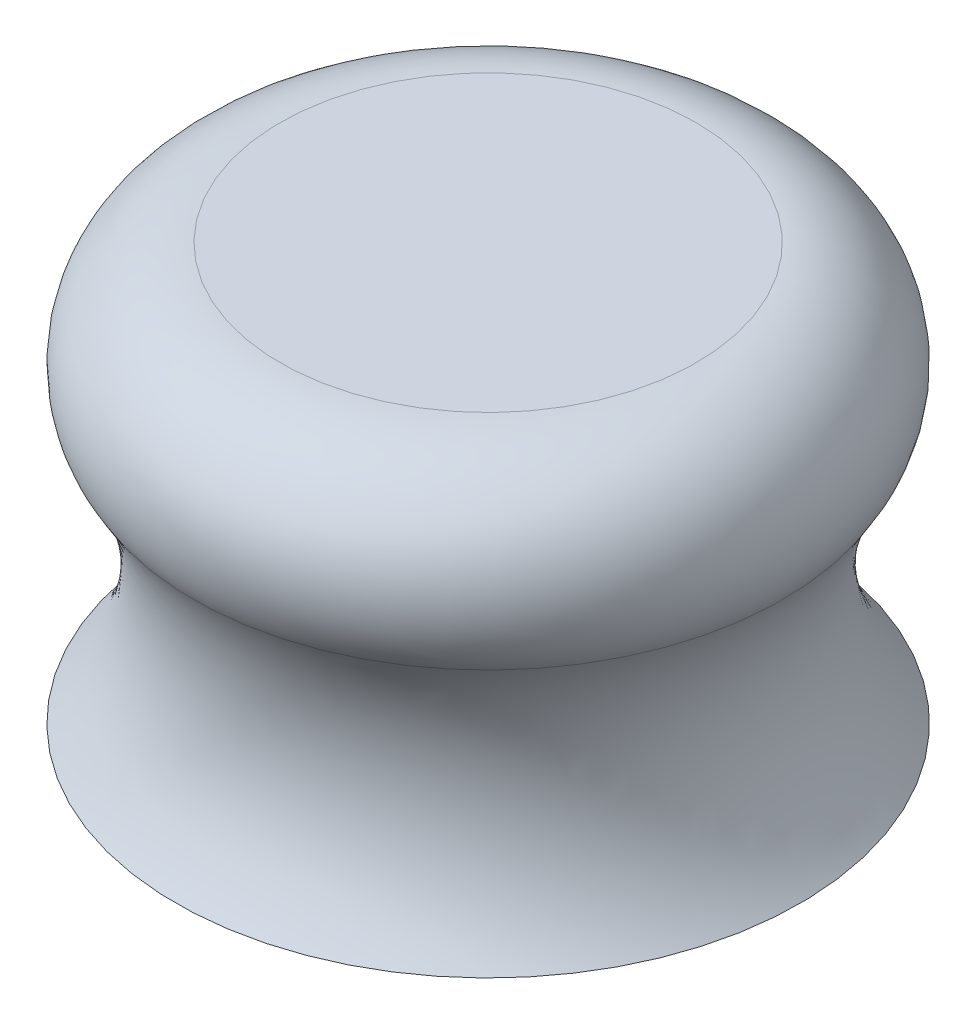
from build123d import *


with BuildPart() as part:
    # Szkic1 → Obr_t1 (revolve)
    with BuildSketch(Plane.XY, mode=Mode.PRIVATE) as obr_t1_sk:
        with BuildLine():
            Line((0, 0), (0, 40))
            Line((0, 40), (20, 40))
            ThreePointArc((20, 40), (28.821425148, 34.709825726), (28.309475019, 24.436491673))
            ThreePointArc((28.309475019, 24.436491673), (24.976113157, 11.929167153), (30, 0))
            Line((30, 0), (0, 0))
        make_face()
    revolve(obr_t1_sk.sketch.rotate(Axis((0, 40, 0), (0, 1, 0)), 90), axis=Axis((0, 40, 0), (0, 1, 0)))


solid = part.part
